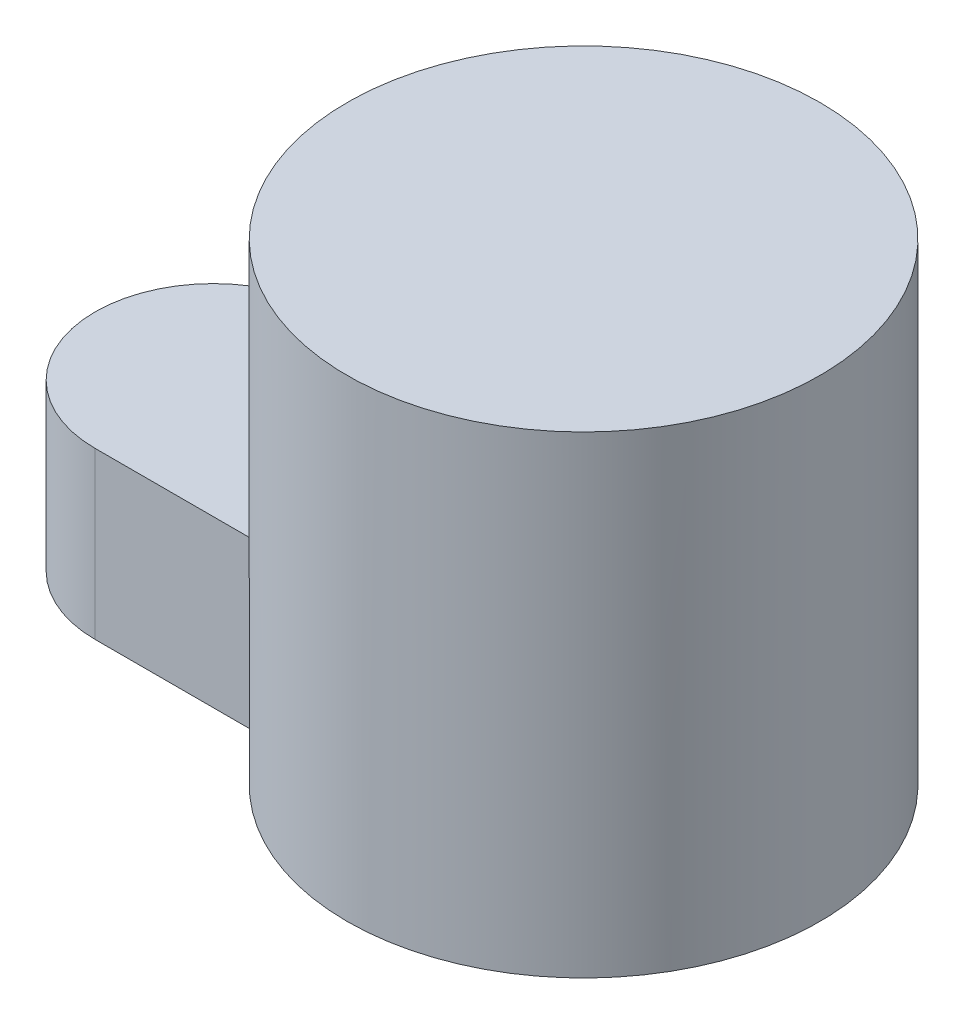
from build123d import *

# Parameters (mm, degrees)
SKETCH1_R      = 50
EXTRUDE1_DEPTH = 100
EXTRUDE2_DEPTH = 35


with BuildPart() as part:
    # Sketch1 → Extrude1 (new body)
    with BuildSketch(Plane(origin=(0, 0, 0), x_dir=(1, 0, 0), z_dir=(0, 1, 0))):
        with Locations(Location((0, 0, 0), (0, 0, 90))):
            Circle(SKETCH1_R)
    extrude(amount=EXTRUDE1_DEPTH)

    # Sketch → Extrude2 (add)
    with BuildSketch(Plane(origin=(0, 0, 0), x_dir=(1, 0, 0), z_dir=(0, 1, 0))):
        with BuildLine():
            ThreePointArc((-43.301270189, -25), (-50, 0), (-43.301270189, 25))
            Line((-43.301270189, 25), (-78.301270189, 25))
            ThreePointArc((-78.301270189, 25), (-103.301270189, 0), (-78.301270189, -25))
            Line((-78.301270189, -25), (-43.301270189, -25))
        make_face()
    extrude(amount=EXTRUDE2_DEPTH)


solid = part.part
